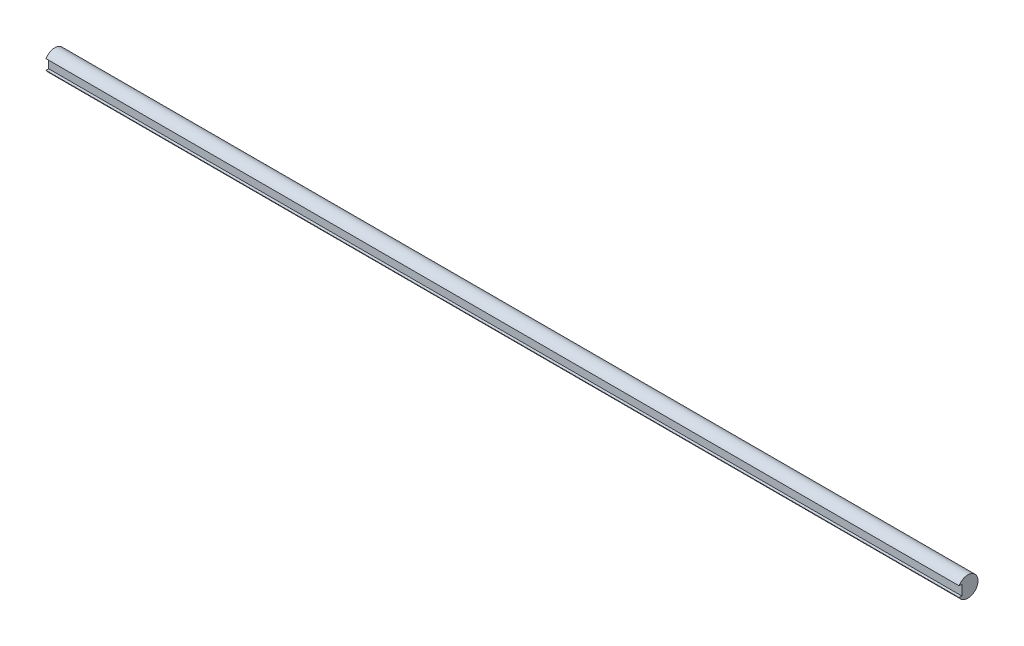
ISO-10303-21;
HEADER;
FILE_DESCRIPTION(('STEP AP214'),'2;1');
FILE_NAME('part.step','',(''),(''),'','','');
FILE_SCHEMA(('AUTOMOTIVE_DESIGN { 1 0 10303 214 1 1 1 1 }'));
ENDSEC;
DATA;
#1=APPLICATION_CONTEXT('core data for automotive mechanical design processes');
#2=APPLICATION_PROTOCOL_DEFINITION('international standard','automotive_design',2000,#1);
#3=PRODUCT_CONTEXT('',#1,'mechanical');
#4=PRODUCT('Part','Part','',(#3));
#5=PRODUCT_RELATED_PRODUCT_CATEGORY('part','',(#4));
#6=PRODUCT_DEFINITION_FORMATION('','',#4);
#7=PRODUCT_DEFINITION_CONTEXT('part definition',#1,'design');
#8=PRODUCT_DEFINITION('design','',#6,#7);
#9=PRODUCT_DEFINITION_SHAPE('','',#8);
#10=(LENGTH_UNIT() NAMED_UNIT(*) SI_UNIT(.MILLI.,.METRE.));
#11=(NAMED_UNIT(*) PLANE_ANGLE_UNIT() SI_UNIT($,.RADIAN.));
#12=(NAMED_UNIT(*) SI_UNIT($,.STERADIAN.) SOLID_ANGLE_UNIT());
#13=UNCERTAINTY_MEASURE_WITH_UNIT(LENGTH_MEASURE(1.E-05),#10,'distance_accuracy_value','');
#14=(GEOMETRIC_REPRESENTATION_CONTEXT(3) GLOBAL_UNCERTAINTY_ASSIGNED_CONTEXT((#13)) GLOBAL_UNIT_ASSIGNED_CONTEXT((#10,
#11,#12)) REPRESENTATION_CONTEXT('',''));
#15=CARTESIAN_POINT('',(0.,0.,0.));
#16=DIRECTION('',(0.,0.,1.));
#17=DIRECTION('',(1.,0.,0.));
#18=AXIS2_PLACEMENT_3D('',#15,#16,#17);
#19=CARTESIAN_POINT('',(225.,0.,0.));
#20=DIRECTION('',(-1.,0.,0.));
#21=DIRECTION('',(0.,0.,1.));
#22=AXIS2_PLACEMENT_3D('',#19,#20,#21);
#23=CYLINDRICAL_SURFACE('',#22,5.);
#24=CARTESIAN_POINT('',(225.,0.,0.));
#25=DIRECTION('',(1.,0.,0.));
#26=DIRECTION('',(0.,0.,-1.));
#27=AXIS2_PLACEMENT_3D('',#24,#25,#26);
#28=CIRCLE('',#27,5.);
#29=CARTESIAN_POINT('',(225.,-2.5,4.33012701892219));
#30=VERTEX_POINT('',#29);
#31=CARTESIAN_POINT('',(225.,2.5,4.33012701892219));
#32=VERTEX_POINT('',#31);
#33=EDGE_CURVE('E40',#30,#32,#28,.T.);
#34=ORIENTED_EDGE('',*,*,#33,.F.);
#35=DIRECTION('',(-1.,0.,0.));
#36=VECTOR('',#35,1.);
#37=CARTESIAN_POINT('',(225.,-2.5,4.33012701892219));
#38=LINE('',#37,#36);
#39=CARTESIAN_POINT('',(-225.,-2.5,4.33012701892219));
#40=VERTEX_POINT('',#39);
#41=EDGE_CURVE('E99',#30,#40,#38,.T.);
#42=ORIENTED_EDGE('',*,*,#41,.T.);
#43=CARTESIAN_POINT('',(-225.,0.,0.));
#44=DIRECTION('',(1.,0.,0.));
#45=DIRECTION('',(0.,0.,-1.));
#46=AXIS2_PLACEMENT_3D('',#43,#44,#45);
#47=CIRCLE('',#46,5.);
#48=CARTESIAN_POINT('',(-225.,2.5,4.33012701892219));
#49=VERTEX_POINT('',#48);
#50=EDGE_CURVE('E101',#40,#49,#47,.T.);
#51=ORIENTED_EDGE('',*,*,#50,.T.);
#52=DIRECTION('',(-1.,0.,0.));
#53=VECTOR('',#52,1.);
#54=CARTESIAN_POINT('',(225.,2.5,4.33012701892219));
#55=LINE('',#54,#53);
#56=EDGE_CURVE('E47',#49,#32,#55,.F.);
#57=ORIENTED_EDGE('',*,*,#56,.T.);
#58=EDGE_LOOP('',(#34,#42,#51,#57));
#59=FACE_BOUND('',#58,.T.);
#60=ADVANCED_FACE('F33',(#59),#23,.T.);
#61=CARTESIAN_POINT('',(225.,0.,0.));
#62=DIRECTION('',(1.,0.,0.));
#63=DIRECTION('',(0.,0.,-1.));
#64=AXIS2_PLACEMENT_3D('',#61,#62,#63);
#65=PLANE('',#64);
#66=DIRECTION('',(0.,0.,-1.));
#67=VECTOR('',#66,1.);
#68=CARTESIAN_POINT('',(225.,-2.5,5.));
#69=LINE('',#68,#67);
#70=CARTESIAN_POINT('',(225.,-2.5,3.));
#71=VERTEX_POINT('',#70);
#72=EDGE_CURVE('E90',#30,#71,#69,.T.);
#73=ORIENTED_EDGE('',*,*,#72,.F.);
#74=ORIENTED_EDGE('',*,*,#33,.T.);
#75=DIRECTION('',(0.,0.,1.));
#76=VECTOR('',#75,1.);
#77=CARTESIAN_POINT('',(225.,2.5,5.));
#78=LINE('',#77,#76);
#79=CARTESIAN_POINT('',(225.,2.5,3.));
#80=VERTEX_POINT('',#79);
#81=EDGE_CURVE('E73',#80,#32,#78,.T.);
#82=ORIENTED_EDGE('',*,*,#81,.F.);
#83=DIRECTION('',(0.,1.,0.));
#84=VECTOR('',#83,1.);
#85=CARTESIAN_POINT('',(225.,-2.5,3.));
#86=LINE('',#85,#84);
#87=EDGE_CURVE('E82',#71,#80,#86,.T.);
#88=ORIENTED_EDGE('',*,*,#87,.F.);
#89=EDGE_LOOP('',(#73,#74,#82,#88));
#90=FACE_BOUND('',#89,.T.);
#91=ADVANCED_FACE('F88',(#90),#65,.T.);
#92=CARTESIAN_POINT('',(-225.,0.,0.));
#93=DIRECTION('',(1.,0.,0.));
#94=DIRECTION('',(0.,0.,-1.));
#95=AXIS2_PLACEMENT_3D('',#92,#93,#94);
#96=PLANE('',#95);
#97=ORIENTED_EDGE('',*,*,#50,.F.);
#98=DIRECTION('',(0.,0.,-1.));
#99=VECTOR('',#98,1.);
#100=CARTESIAN_POINT('',(-225.,-2.5,0.));
#101=LINE('',#100,#99);
#102=CARTESIAN_POINT('',(-225.,-2.5,3.));
#103=VERTEX_POINT('',#102);
#104=EDGE_CURVE('E11',#40,#103,#101,.T.);
#105=ORIENTED_EDGE('',*,*,#104,.T.);
#106=DIRECTION('',(0.,1.,0.));
#107=VECTOR('',#106,1.);
#108=CARTESIAN_POINT('',(-225.,-2.5,3.));
#109=LINE('',#108,#107);
#110=CARTESIAN_POINT('',(-225.,2.5,3.));
#111=VERTEX_POINT('',#110);
#112=EDGE_CURVE('E92',#103,#111,#109,.T.);
#113=ORIENTED_EDGE('',*,*,#112,.T.);
#114=DIRECTION('',(0.,0.,1.));
#115=VECTOR('',#114,1.);
#116=CARTESIAN_POINT('',(-225.,2.5,5.));
#117=LINE('',#116,#115);
#118=EDGE_CURVE('E74',#111,#49,#117,.T.);
#119=ORIENTED_EDGE('',*,*,#118,.T.);
#120=EDGE_LOOP('',(#97,#105,#113,#119));
#121=FACE_BOUND('',#120,.T.);
#122=ADVANCED_FACE('F106',(#121),#96,.F.);
#123=CARTESIAN_POINT('',(-225.,-2.5,5.));
#124=DIRECTION('',(0.,-1.,0.));
#125=DIRECTION('',(0.,0.,-1.));
#126=AXIS2_PLACEMENT_3D('',#123,#124,#125);
#127=PLANE('',#126);
#128=ORIENTED_EDGE('',*,*,#72,.T.);
#129=DIRECTION('',(1.,0.,0.));
#130=VECTOR('',#129,1.);
#131=CARTESIAN_POINT('',(-225.,-2.5,3.));
#132=LINE('',#131,#130);
#133=EDGE_CURVE('E78',#103,#71,#132,.T.);
#134=ORIENTED_EDGE('',*,*,#133,.F.);
#135=ORIENTED_EDGE('',*,*,#104,.F.);
#136=ORIENTED_EDGE('',*,*,#41,.F.);
#137=EDGE_LOOP('',(#128,#134,#135,#136));
#138=FACE_BOUND('',#137,.T.);
#139=ADVANCED_FACE('F108',(#138),#127,.F.);
#140=CARTESIAN_POINT('',(-225.,2.5,5.));
#141=DIRECTION('',(0.,1.,0.));
#142=DIRECTION('',(0.,0.,1.));
#143=AXIS2_PLACEMENT_3D('',#140,#141,#142);
#144=PLANE('',#143);
#145=ORIENTED_EDGE('',*,*,#118,.F.);
#146=DIRECTION('',(1.,0.,0.));
#147=VECTOR('',#146,1.);
#148=CARTESIAN_POINT('',(-225.,2.5,3.));
#149=LINE('',#148,#147);
#150=EDGE_CURVE('E69',#111,#80,#149,.T.);
#151=ORIENTED_EDGE('',*,*,#150,.T.);
#152=ORIENTED_EDGE('',*,*,#81,.T.);
#153=ORIENTED_EDGE('',*,*,#56,.F.);
#154=EDGE_LOOP('',(#145,#151,#152,#153));
#155=FACE_BOUND('',#154,.T.);
#156=ADVANCED_FACE('F71',(#155),#144,.F.);
#157=CARTESIAN_POINT('',(-225.,-2.5,3.));
#158=DIRECTION('',(0.,0.,-1.));
#159=DIRECTION('',(-1.,0.,0.));
#160=AXIS2_PLACEMENT_3D('',#157,#158,#159);
#161=PLANE('',#160);
#162=ORIENTED_EDGE('',*,*,#150,.F.);
#163=ORIENTED_EDGE('',*,*,#112,.F.);
#164=ORIENTED_EDGE('',*,*,#133,.T.);
#165=ORIENTED_EDGE('',*,*,#87,.T.);
#166=EDGE_LOOP('',(#162,#163,#164,#165));
#167=FACE_BOUND('',#166,.T.);
#168=ADVANCED_FACE('F83',(#167),#161,.F.);
#169=CLOSED_SHELL('',(#60,#91,#122,#139,#156,#168));
#170=MANIFOLD_SOLID_BREP('B2',#169);
#171=ADVANCED_BREP_SHAPE_REPRESENTATION('',(#18,#170),#14);
#172=SHAPE_DEFINITION_REPRESENTATION(#9,#171);
ENDSEC;
END-ISO-10303-21;
